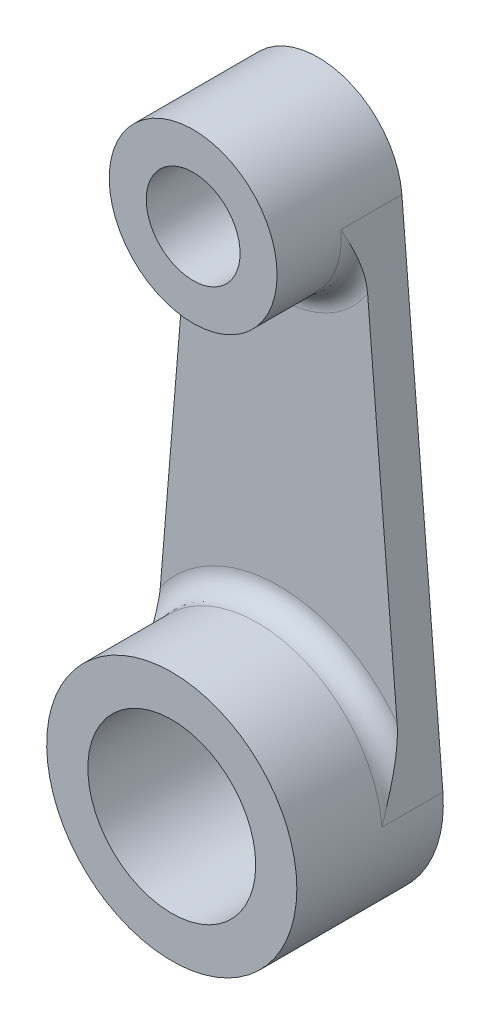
ISO-10303-21;
HEADER;
FILE_DESCRIPTION(('STEP AP214'),'2;1');
FILE_NAME('part.step','',(''),(''),'','','');
FILE_SCHEMA(('AUTOMOTIVE_DESIGN { 1 0 10303 214 1 1 1 1 }'));
ENDSEC;
DATA;
#1=APPLICATION_CONTEXT('core data for automotive mechanical design processes');
#2=APPLICATION_PROTOCOL_DEFINITION('international standard','automotive_design',2000,#1);
#3=PRODUCT_CONTEXT('',#1,'mechanical');
#4=PRODUCT('Part','Part','',(#3));
#5=PRODUCT_RELATED_PRODUCT_CATEGORY('part','',(#4));
#6=PRODUCT_DEFINITION_FORMATION('','',#4);
#7=PRODUCT_DEFINITION_CONTEXT('part definition',#1,'design');
#8=PRODUCT_DEFINITION('design','',#6,#7);
#9=PRODUCT_DEFINITION_SHAPE('','',#8);
#10=(LENGTH_UNIT() NAMED_UNIT(*) SI_UNIT(.MILLI.,.METRE.));
#11=(NAMED_UNIT(*) PLANE_ANGLE_UNIT() SI_UNIT($,.RADIAN.));
#12=(NAMED_UNIT(*) SI_UNIT($,.STERADIAN.) SOLID_ANGLE_UNIT());
#13=UNCERTAINTY_MEASURE_WITH_UNIT(LENGTH_MEASURE(1.E-05),#10,'distance_accuracy_value','');
#14=(GEOMETRIC_REPRESENTATION_CONTEXT(3) GLOBAL_UNCERTAINTY_ASSIGNED_CONTEXT((#13)) GLOBAL_UNIT_ASSIGNED_CONTEXT((#10,
#11,#12)) REPRESENTATION_CONTEXT('',''));
#15=CARTESIAN_POINT('',(0.,0.,0.));
#16=DIRECTION('',(0.,0.,1.));
#17=DIRECTION('',(1.,0.,0.));
#18=AXIS2_PLACEMENT_3D('',#15,#16,#17);
#19=CARTESIAN_POINT('',(0.,0.,44.5));
#20=DIRECTION('',(0.,0.,-1.));
#21=DIRECTION('',(-1.,0.,0.));
#22=AXIS2_PLACEMENT_3D('',#19,#20,#21);
#23=CYLINDRICAL_SURFACE('',#22,38.);
#24=CARTESIAN_POINT('',(0.,0.,18.5));
#25=DIRECTION('',(0.,0.,1.));
#26=DIRECTION('',(1.,0.,0.));
#27=AXIS2_PLACEMENT_3D('',#24,#25,#26);
#28=CIRCLE('',#27,38.);
#29=CARTESIAN_POINT('',(37.8712869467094,3.125,18.5));
#30=VERTEX_POINT('',#29);
#31=CARTESIAN_POINT('',(-37.8712869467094,3.125,18.5));
#32=VERTEX_POINT('',#31);
#33=EDGE_CURVE('E140',#30,#32,#28,.T.);
#34=ORIENTED_EDGE('',*,*,#33,.T.);
#35=DIRECTION('',(0.,0.,-1.));
#36=VECTOR('',#35,1.);
#37=CARTESIAN_POINT('',(-37.8712869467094,3.125,12.));
#38=LINE('',#37,#36);
#39=CARTESIAN_POINT('',(-37.8712869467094,3.125,0.));
#40=VERTEX_POINT('',#39);
#41=EDGE_CURVE('E104',#32,#40,#38,.T.);
#42=ORIENTED_EDGE('',*,*,#41,.T.);
#43=CARTESIAN_POINT('',(0.,0.,0.));
#44=DIRECTION('',(0.,0.,1.));
#45=DIRECTION('',(1.,0.,0.));
#46=AXIS2_PLACEMENT_3D('',#43,#44,#45);
#47=CIRCLE('',#46,38.);
#48=CARTESIAN_POINT('',(37.8712869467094,3.125,0.));
#49=VERTEX_POINT('',#48);
#50=EDGE_CURVE('E103',#40,#49,#47,.T.);
#51=ORIENTED_EDGE('',*,*,#50,.T.);
#52=DIRECTION('',(0.,0.,-1.));
#53=VECTOR('',#52,1.);
#54=CARTESIAN_POINT('',(37.8712869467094,3.125,12.));
#55=LINE('',#54,#53);
#56=EDGE_CURVE('E133',#30,#49,#55,.T.);
#57=ORIENTED_EDGE('',*,*,#56,.F.);
#58=EDGE_LOOP('',(#34,#42,#51,#57));
#59=FACE_BOUND('',#58,.T.);
#60=CARTESIAN_POINT('',(0.,0.,44.5));
#61=DIRECTION('',(0.,0.,1.));
#62=DIRECTION('',(1.,0.,0.));
#63=AXIS2_PLACEMENT_3D('',#60,#61,#62);
#64=CIRCLE('',#63,38.);
#65=CARTESIAN_POINT('',(38.,0.,44.5));
#66=VERTEX_POINT('',#65);
#67=EDGE_CURVE('E137',#66,#66,#64,.T.);
#68=ORIENTED_EDGE('',*,*,#67,.F.);
#69=EDGE_LOOP('',(#68));
#70=FACE_BOUND('',#69,.T.);
#71=ADVANCED_FACE('F39',(#59,#70),#23,.T.);
#72=CARTESIAN_POINT('',(0.,0.,44.5));
#73=DIRECTION('',(0.,0.,1.));
#74=DIRECTION('',(1.,0.,0.));
#75=AXIS2_PLACEMENT_3D('',#72,#73,#74);
#76=PLANE('',#75);
#77=CARTESIAN_POINT('',(0.,0.,44.5));
#78=DIRECTION('',(0.,0.,1.));
#79=DIRECTION('',(1.,0.,0.));
#80=AXIS2_PLACEMENT_3D('',#77,#78,#79);
#81=CIRCLE('',#80,25.5);
#82=CARTESIAN_POINT('',(25.5,0.,44.5));
#83=VERTEX_POINT('',#82);
#84=EDGE_CURVE('E121',#83,#83,#81,.T.);
#85=ORIENTED_EDGE('',*,*,#84,.F.);
#86=EDGE_LOOP('',(#85));
#87=FACE_BOUND('',#86,.T.);
#88=ORIENTED_EDGE('',*,*,#67,.T.);
#89=EDGE_LOOP('',(#88));
#90=FACE_BOUND('',#89,.T.);
#91=ADVANCED_FACE('F175',(#87,#90),#76,.T.);
#92=CARTESIAN_POINT('',(0.,0.,0.));
#93=DIRECTION('',(0.,0.,1.));
#94=DIRECTION('',(1.,0.,0.));
#95=AXIS2_PLACEMENT_3D('',#92,#93,#94);
#96=PLANE('',#95);
#97=CARTESIAN_POINT('',(0.,152.,0.));
#98=DIRECTION('',(0.,0.,1.));
#99=DIRECTION('',(1.,0.,0.));
#100=AXIS2_PLACEMENT_3D('',#97,#98,#99);
#101=CIRCLE('',#100,14.25);
#102=CARTESIAN_POINT('',(14.25,152.,0.));
#103=VERTEX_POINT('',#102);
#104=EDGE_CURVE('E145',#103,#103,#101,.T.);
#105=ORIENTED_EDGE('',*,*,#104,.T.);
#106=EDGE_LOOP('',(#105));
#107=FACE_BOUND('',#106,.T.);
#108=CARTESIAN_POINT('',(0.,0.,0.));
#109=DIRECTION('',(0.,0.,1.));
#110=DIRECTION('',(1.,0.,0.));
#111=AXIS2_PLACEMENT_3D('',#108,#109,#110);
#112=CIRCLE('',#111,25.5);
#113=CARTESIAN_POINT('',(25.5,0.,0.));
#114=VERTEX_POINT('',#113);
#115=EDGE_CURVE('E116',#114,#114,#112,.T.);
#116=ORIENTED_EDGE('',*,*,#115,.T.);
#117=EDGE_LOOP('',(#116));
#118=FACE_BOUND('',#117,.T.);
#119=ORIENTED_EDGE('',*,*,#50,.F.);
#120=DIRECTION('',(-0.0822368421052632,-0.996612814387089,0.));
#121=VECTOR('',#120,1.);
#122=CARTESIAN_POINT('',(-37.8712869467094,3.125,0.));
#123=LINE('',#122,#121);
#124=CARTESIAN_POINT('',(-25.4136267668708,154.097039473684,0.));
#125=VERTEX_POINT('',#124);
#126=EDGE_CURVE('E99',#125,#40,#123,.T.);
#127=ORIENTED_EDGE('',*,*,#126,.F.);
#128=CARTESIAN_POINT('',(0.,152.,0.));
#129=DIRECTION('',(0.,0.,1.));
#130=DIRECTION('',(1.,0.,0.));
#131=AXIS2_PLACEMENT_3D('',#128,#129,#130);
#132=CIRCLE('',#131,25.5);
#133=CARTESIAN_POINT('',(25.4136267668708,154.097039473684,0.));
#134=VERTEX_POINT('',#133);
#135=EDGE_CURVE('E110',#134,#125,#132,.T.);
#136=ORIENTED_EDGE('',*,*,#135,.F.);
#137=DIRECTION('',(0.0822368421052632,-0.996612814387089,0.));
#138=VECTOR('',#137,1.);
#139=CARTESIAN_POINT('',(37.8712869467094,3.125,0.));
#140=LINE('',#139,#138);
#141=EDGE_CURVE('E112',#134,#49,#140,.T.);
#142=ORIENTED_EDGE('',*,*,#141,.T.);
#143=EDGE_LOOP('',(#119,#127,#136,#142));
#144=FACE_BOUND('',#143,.T.);
#145=ADVANCED_FACE('F108',(#107,#118,#144),#96,.F.);
#146=CARTESIAN_POINT('',(-37.8712869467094,3.125,12.));
#147=DIRECTION('',(0.996612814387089,-0.0822368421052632,0.));
#148=DIRECTION('',(0.0822368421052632,0.996612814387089,0.));
#149=AXIS2_PLACEMENT_3D('',#146,#147,#148);
#150=PLANE('',#149);
#151=ORIENTED_EDGE('',*,*,#126,.T.);
#152=ORIENTED_EDGE('',*,*,#41,.F.);
#153=CARTESIAN_POINT('',(-35.9669224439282,26.2036350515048,12.));
#154=CARTESIAN_POINT('',(-35.9853294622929,25.9805638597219,12.0000043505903));
#155=CARTESIAN_POINT('',(-36.0037350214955,25.757510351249,12.0031303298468));
#156=CARTESIAN_POINT('',(-36.0405313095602,25.3115830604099,12.0152626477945));
#157=CARTESIAN_POINT('',(-36.058922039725,25.0887092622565,12.0242683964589));
#158=CARTESIAN_POINT('',(-36.1140366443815,24.4207857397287,12.0595473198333));
#159=CARTESIAN_POINT('',(-36.1507260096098,23.9761542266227,12.0940830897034));
#160=CARTESIAN_POINT('',(-36.2238397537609,23.0901025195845,12.1825233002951));
#161=CARTESIAN_POINT('',(-36.2602645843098,22.6486768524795,12.2363740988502));
#162=CARTESIAN_POINT('',(-36.3329187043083,21.7681952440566,12.3612735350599));
#163=CARTESIAN_POINT('',(-36.3691479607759,21.3291397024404,12.4323249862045));
#164=CARTESIAN_POINT('',(-36.44102151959,20.4581175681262,12.5888989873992));
#165=CARTESIAN_POINT('',(-36.4766680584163,20.0261238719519,12.6742708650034));
#166=CARTESIAN_POINT('',(-36.5477293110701,19.1649459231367,12.8583020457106));
#167=CARTESIAN_POINT('',(-36.5831440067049,18.7357618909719,12.9569623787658));
#168=CARTESIAN_POINT('',(-36.6890829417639,17.4519078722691,13.2707293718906));
#169=CARTESIAN_POINT('',(-36.7592554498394,16.601500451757,13.5035165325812));
#170=CARTESIAN_POINT('',(-36.8732736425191,15.2197354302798,13.91416764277));
#171=CARTESIAN_POINT('',(-36.9173921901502,14.6850710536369,14.0811223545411));
#172=CARTESIAN_POINT('',(-37.0052975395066,13.6197626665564,14.4275558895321));
#173=CARTESIAN_POINT('',(-37.0490843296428,13.0891187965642,14.6070351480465));
#174=CARTESIAN_POINT('',(-37.1800169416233,11.5023711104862,15.1611252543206));
#175=CARTESIAN_POINT('',(-37.2667157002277,10.4516851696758,15.5513168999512));
#176=CARTESIAN_POINT('',(-37.5259131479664,7.31052007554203,16.7630204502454));
#177=CARTESIAN_POINT('',(-37.6971331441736,5.23553716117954,17.6241464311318));
#178=CARTESIAN_POINT('',(-37.8693117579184,3.14893694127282,18.4900664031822));
#179=CARTESIAN_POINT('',(-37.8702993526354,3.13696846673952,18.4950332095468));
#180=CARTESIAN_POINT('',(-37.8712869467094,3.125,18.5));
#181=B_SPLINE_CURVE_WITH_KNOTS('',3,(#153,#154,#155,#156,#157,#158,#159,#160,#161,#162,#163,
#164,#165,#166,#167,#168,#169,#170,#171,#172,#173,#174,#175,#176,#177,#178,#179,#180),
.UNSPECIFIED.,.F.,.F.,(4,2,2,2,2,2,2,2,2,2,2,2,2,4),(0.,0.67143658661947,1.34280580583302,
2.68470339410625,4.02290272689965,5.36132109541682,6.68645163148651,8.0116849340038,
10.6638774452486,12.3493322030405,14.0348455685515,17.4066079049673,24.1646919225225,
24.203679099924),.UNSPECIFIED.);
#182=CARTESIAN_POINT('',(-35.9669224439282,26.2036350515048,12.));
#183=VERTEX_POINT('',#182);
#184=EDGE_CURVE('E154',#32,#183,#181,.F.);
#185=ORIENTED_EDGE('',*,*,#184,.T.);
#186=DIRECTION('',(-0.0822368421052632,-0.996612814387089,0.));
#187=VECTOR('',#186,1.);
#188=CARTESIAN_POINT('',(-37.8712869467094,3.125,12.));
#189=LINE('',#188,#187);
#190=CARTESIAN_POINT('',(-27.0034799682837,134.829907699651,12.));
#191=VERTEX_POINT('',#190);
#192=EDGE_CURVE('E125',#191,#183,#189,.T.);
#193=ORIENTED_EDGE('',*,*,#192,.F.);
#194=CARTESIAN_POINT('',(-27.0034799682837,134.829907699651,12.));
#195=CARTESIAN_POINT('',(-26.9754955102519,135.169046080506,12.000030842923));
#196=CARTESIAN_POINT('',(-26.947519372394,135.508083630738,12.0097513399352));
#197=CARTESIAN_POINT('',(-26.891660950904,136.185021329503,12.0468251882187));
#198=CARTESIAN_POINT('',(-26.8637786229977,136.522922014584,12.0741685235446));
#199=CARTESIAN_POINT('',(-26.8082350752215,137.196043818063,12.1446415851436));
#200=CARTESIAN_POINT('',(-26.7805734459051,137.531269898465,12.1877245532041));
#201=CARTESIAN_POINT('',(-26.7254240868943,138.199614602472,12.2881780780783));
#202=CARTESIAN_POINT('',(-26.6979363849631,138.532732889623,12.3455508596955));
#203=CARTESIAN_POINT('',(-26.6165099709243,139.519524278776,12.5352853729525));
#204=CARTESIAN_POINT('',(-26.5628619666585,140.16967434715,12.6862892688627));
#205=CARTESIAN_POINT('',(-26.4564288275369,141.45951753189,13.0291653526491));
#206=CARTESIAN_POINT('',(-26.4036444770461,142.099201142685,13.2210726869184));
#207=CARTESIAN_POINT('',(-26.310818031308,143.224147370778,13.5906318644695));
#208=CARTESIAN_POINT('',(-26.2705958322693,143.711592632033,13.76167991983));
#209=CARTESIAN_POINT('',(-26.1906516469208,144.68042117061,14.1203147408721));
#210=CARTESIAN_POINT('',(-26.150929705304,145.161803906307,14.3079029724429));
#211=CARTESIAN_POINT('',(-26.0324482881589,146.597657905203,14.8910785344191));
#212=CARTESIAN_POINT('',(-25.9543705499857,147.543867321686,15.3070877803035));
#213=CARTESIAN_POINT('',(-25.7992276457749,149.424014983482,16.1749934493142));
#214=CARTESIAN_POINT('',(-25.7221677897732,150.35788887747,16.6270269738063));
#215=CARTESIAN_POINT('',(-25.5687275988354,152.217401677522,17.5478846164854));
#216=CARTESIAN_POINT('',(-25.4923473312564,153.143039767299,18.0167103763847));
#217=CARTESIAN_POINT('',(-25.4151898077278,154.078097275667,18.4904039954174));
#218=CARTESIAN_POINT('',(-25.4144082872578,154.087568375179,18.4952019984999));
#219=CARTESIAN_POINT('',(-25.4136267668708,154.097039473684,18.5));
#220=B_SPLINE_CURVE_WITH_KNOTS('',3,(#194,#195,#196,#197,#198,#199,#200,#201,#202,#203,#204,
#205,#206,#207,#208,#209,#210,#211,#212,#213,#214,#215,#216,#217,#218,#219),.UNSPECIFIED.,.F.,
.F.,(4,2,2,2,2,2,2,2,2,2,2,2,4),(0.,1.02058876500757,2.04059798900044,3.05760135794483,
4.07476316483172,6.08177897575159,8.09052632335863,9.64464139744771,11.1988943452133,
14.3072975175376,17.4281542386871,20.549316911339,20.5812543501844),.UNSPECIFIED.);
#221=CARTESIAN_POINT('',(-25.4136267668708,154.097039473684,18.5));
#222=VERTEX_POINT('',#221);
#223=EDGE_CURVE('E11',#191,#222,#220,.T.);
#224=ORIENTED_EDGE('',*,*,#223,.T.);
#225=DIRECTION('',(0.,0.,-1.));
#226=VECTOR('',#225,1.);
#227=CARTESIAN_POINT('',(-25.4136267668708,154.097039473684,12.));
#228=LINE('',#227,#226);
#229=EDGE_CURVE('E68',#222,#125,#228,.T.);
#230=ORIENTED_EDGE('',*,*,#229,.T.);
#231=EDGE_LOOP('',(#151,#152,#185,#193,#224,#230));
#232=FACE_BOUND('',#231,.T.);
#233=ADVANCED_FACE('F98',(#232),#150,.F.);
#234=CARTESIAN_POINT('',(37.8712869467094,3.125,12.));
#235=DIRECTION('',(0.996612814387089,0.0822368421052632,0.));
#236=DIRECTION('',(-0.0822368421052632,0.996612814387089,0.));
#237=AXIS2_PLACEMENT_3D('',#234,#235,#236);
#238=PLANE('',#237);
#239=ORIENTED_EDGE('',*,*,#141,.F.);
#240=DIRECTION('',(0.,0.,-1.));
#241=VECTOR('',#240,1.);
#242=CARTESIAN_POINT('',(25.4136267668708,154.097039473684,12.));
#243=LINE('',#242,#241);
#244=CARTESIAN_POINT('',(25.4136267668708,154.097039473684,18.5));
#245=VERTEX_POINT('',#244);
#246=EDGE_CURVE('E60',#245,#134,#243,.T.);
#247=ORIENTED_EDGE('',*,*,#246,.F.);
#248=CARTESIAN_POINT('',(27.0034799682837,134.829907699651,12.));
#249=CARTESIAN_POINT('',(26.975495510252,135.169046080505,12.000030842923));
#250=CARTESIAN_POINT('',(26.9475193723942,135.508083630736,12.0097513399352));
#251=CARTESIAN_POINT('',(26.8916609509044,136.185021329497,12.0468251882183));
#252=CARTESIAN_POINT('',(26.8637786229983,136.522922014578,12.074168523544));
#253=CARTESIAN_POINT('',(26.8082350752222,137.196043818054,12.1446415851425));
#254=CARTESIAN_POINT('',(26.7805734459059,137.531269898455,12.1877245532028));
#255=CARTESIAN_POINT('',(26.7254240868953,138.19961460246,12.2881780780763));
#256=CARTESIAN_POINT('',(26.6979363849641,138.53273288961,12.3455508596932));
#257=CARTESIAN_POINT('',(26.6165099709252,139.519524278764,12.53528537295));
#258=CARTESIAN_POINT('',(26.5628619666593,140.169674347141,12.6862892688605));
#259=CARTESIAN_POINT('',(26.4564288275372,141.459517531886,13.0291653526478));
#260=CARTESIAN_POINT('',(26.4036444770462,142.099201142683,13.2210726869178));
#261=CARTESIAN_POINT('',(26.3108180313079,143.224147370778,13.5906318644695));
#262=CARTESIAN_POINT('',(26.2705958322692,143.711592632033,13.7616799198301));
#263=CARTESIAN_POINT('',(26.1906516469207,144.680421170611,14.1203147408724));
#264=CARTESIAN_POINT('',(26.1509297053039,145.161803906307,14.3079029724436));
#265=CARTESIAN_POINT('',(26.0324482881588,146.597657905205,14.8910785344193));
#266=CARTESIAN_POINT('',(25.9543705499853,147.54386732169,15.3070877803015));
#267=CARTESIAN_POINT('',(25.7992276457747,149.424014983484,16.174993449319));
#268=CARTESIAN_POINT('',(25.7221677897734,150.357888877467,16.6270269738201));
#269=CARTESIAN_POINT('',(25.5687275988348,152.21740167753,17.5478846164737));
#270=CARTESIAN_POINT('',(25.4923473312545,153.143039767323,18.0167103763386));
#271=CARTESIAN_POINT('',(25.4151898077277,154.078097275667,18.4904039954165));
#272=CARTESIAN_POINT('',(25.4144082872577,154.087568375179,18.4952019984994));
#273=CARTESIAN_POINT('',(25.4136267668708,154.097039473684,18.5));
#274=B_SPLINE_CURVE_WITH_KNOTS('',3,(#248,#249,#250,#251,#252,#253,#254,#255,#256,#257,#258,
#259,#260,#261,#262,#263,#264,#265,#266,#267,#268,#269,#270,#271,#272,#273),.UNSPECIFIED.,.F.,
.F.,(4,2,2,2,2,2,2,2,2,2,2,2,4),(0.,1.02058876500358,2.04059798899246,3.05760135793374,
4.07476316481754,6.08177897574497,8.09052632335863,9.64464139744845,11.1988943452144,
14.3072975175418,17.4281542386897,20.549316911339,20.5812543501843),.UNSPECIFIED.);
#275=CARTESIAN_POINT('',(27.0034799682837,134.829907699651,12.));
#276=VERTEX_POINT('',#275);
#277=EDGE_CURVE('E53',#245,#276,#274,.F.);
#278=ORIENTED_EDGE('',*,*,#277,.T.);
#279=DIRECTION('',(0.0822368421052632,-0.996612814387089,0.));
#280=VECTOR('',#279,1.);
#281=CARTESIAN_POINT('',(37.8712869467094,3.125,12.));
#282=LINE('',#281,#280);
#283=CARTESIAN_POINT('',(35.9669224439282,26.2036350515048,12.));
#284=VERTEX_POINT('',#283);
#285=EDGE_CURVE('E128',#276,#284,#282,.T.);
#286=ORIENTED_EDGE('',*,*,#285,.T.);
#287=CARTESIAN_POINT('',(35.9669224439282,26.2036350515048,12.));
#288=CARTESIAN_POINT('',(35.9853294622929,25.9805638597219,12.0000043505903));
#289=CARTESIAN_POINT('',(36.0037350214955,25.757510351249,12.0031303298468));
#290=CARTESIAN_POINT('',(36.0405313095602,25.3115830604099,12.0152626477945));
#291=CARTESIAN_POINT('',(36.058922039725,25.0887092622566,12.0242683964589));
#292=CARTESIAN_POINT('',(36.1140366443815,24.4207857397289,12.0595473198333));
#293=CARTESIAN_POINT('',(36.1507260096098,23.9761542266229,12.0940830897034));
#294=CARTESIAN_POINT('',(36.2238397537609,23.0901025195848,12.1825233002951));
#295=CARTESIAN_POINT('',(36.2602645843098,22.6486768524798,12.2363740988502));
#296=CARTESIAN_POINT('',(36.3329187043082,21.768195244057,12.3612735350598));
#297=CARTESIAN_POINT('',(36.3691479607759,21.3291397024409,12.4323249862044));
#298=CARTESIAN_POINT('',(36.44102151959,20.4581175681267,12.5888989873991));
#299=CARTESIAN_POINT('',(36.4766680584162,20.0261238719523,12.6742708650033));
#300=CARTESIAN_POINT('',(36.5477293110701,19.164945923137,12.8583020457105));
#301=CARTESIAN_POINT('',(36.5831440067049,18.7357618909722,12.9569623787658));
#302=CARTESIAN_POINT('',(36.6890829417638,17.4519078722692,13.2707293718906));
#303=CARTESIAN_POINT('',(36.7592554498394,16.6015004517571,13.5035165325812));
#304=CARTESIAN_POINT('',(36.8732736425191,15.2197354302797,13.91416764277));
#305=CARTESIAN_POINT('',(36.9173921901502,14.6850710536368,14.0811223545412));
#306=CARTESIAN_POINT('',(37.0052975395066,13.6197626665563,14.4275558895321));
#307=CARTESIAN_POINT('',(37.0490843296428,13.0891187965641,14.6070351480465));
#308=CARTESIAN_POINT('',(37.1800169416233,11.502371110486,15.1611252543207));
#309=CARTESIAN_POINT('',(37.2667157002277,10.4516851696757,15.5513168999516));
#310=CARTESIAN_POINT('',(37.5259131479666,7.31052007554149,16.7630204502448));
#311=CARTESIAN_POINT('',(37.6971331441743,5.23553716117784,17.6241464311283));
#312=CARTESIAN_POINT('',(37.8693117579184,3.14893694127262,18.4900664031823));
#313=CARTESIAN_POINT('',(37.8702993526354,3.13696846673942,18.4950332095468));
#314=CARTESIAN_POINT('',(37.8712869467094,3.125,18.5));
#315=B_SPLINE_CURVE_WITH_KNOTS('',3,(#287,#288,#289,#290,#291,#292,#293,#294,#295,#296,#297,
#298,#299,#300,#301,#302,#303,#304,#305,#306,#307,#308,#309,#310,#311,#312,#313,#314),
.UNSPECIFIED.,.F.,.F.,(4,2,2,2,2,2,2,2,2,2,2,2,2,4),(0.,0.671436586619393,1.34280580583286,
2.68470339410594,4.02290272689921,5.36132109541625,6.6864516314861,8.01168493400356,
10.6638774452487,12.3493322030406,14.0348455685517,17.4066079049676,24.1646919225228,
24.203679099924),.UNSPECIFIED.);
#316=EDGE_CURVE('E160',#284,#30,#315,.T.);
#317=ORIENTED_EDGE('',*,*,#316,.T.);
#318=ORIENTED_EDGE('',*,*,#56,.T.);
#319=EDGE_LOOP('',(#239,#247,#278,#286,#317,#318));
#320=FACE_BOUND('',#319,.T.);
#321=ADVANCED_FACE('F172',(#320),#238,.T.);
#322=CARTESIAN_POINT('',(0.,0.,12.));
#323=DIRECTION('',(0.,0.,1.));
#324=DIRECTION('',(1.,0.,0.));
#325=AXIS2_PLACEMENT_3D('',#322,#323,#324);
#326=PLANE('',#325);
#327=ORIENTED_EDGE('',*,*,#192,.T.);
#328=CARTESIAN_POINT('',(0.,0.,12.));
#329=DIRECTION('',(0.,0.,1.));
#330=DIRECTION('',(1.,0.,0.));
#331=AXIS2_PLACEMENT_3D('',#328,#329,#330);
#332=CIRCLE('',#331,44.5);
#333=EDGE_CURVE('E150',#183,#284,#332,.F.);
#334=ORIENTED_EDGE('',*,*,#333,.T.);
#335=ORIENTED_EDGE('',*,*,#285,.F.);
#336=CARTESIAN_POINT('',(0.,152.,12.));
#337=DIRECTION('',(0.,0.,1.));
#338=DIRECTION('',(1.,0.,0.));
#339=AXIS2_PLACEMENT_3D('',#336,#337,#338);
#340=CIRCLE('',#339,32.);
#341=EDGE_CURVE('E148',#276,#191,#340,.F.);
#342=ORIENTED_EDGE('',*,*,#341,.T.);
#343=EDGE_LOOP('',(#327,#334,#335,#342));
#344=FACE_BOUND('',#343,.T.);
#345=ADVANCED_FACE('F197',(#344),#326,.T.);
#346=CARTESIAN_POINT('',(0.,152.,38.));
#347=DIRECTION('',(0.,0.,-1.));
#348=DIRECTION('',(-1.,0.,0.));
#349=AXIS2_PLACEMENT_3D('',#346,#347,#348);
#350=CYLINDRICAL_SURFACE('',#349,25.5);
#351=CARTESIAN_POINT('',(0.,152.,38.));
#352=DIRECTION('',(0.,0.,1.));
#353=DIRECTION('',(1.,0.,0.));
#354=AXIS2_PLACEMENT_3D('',#351,#352,#353);
#355=CIRCLE('',#354,25.5);
#356=CARTESIAN_POINT('',(25.5,152.,38.));
#357=VERTEX_POINT('',#356);
#358=EDGE_CURVE('E113',#357,#357,#355,.T.);
#359=ORIENTED_EDGE('',*,*,#358,.F.);
#360=EDGE_LOOP('',(#359));
#361=FACE_BOUND('',#360,.T.);
#362=CARTESIAN_POINT('',(0.,152.,18.5));
#363=DIRECTION('',(0.,0.,1.));
#364=DIRECTION('',(1.,0.,0.));
#365=AXIS2_PLACEMENT_3D('',#362,#363,#364);
#366=CIRCLE('',#365,25.5);
#367=EDGE_CURVE('E152',#222,#245,#366,.T.);
#368=ORIENTED_EDGE('',*,*,#367,.T.);
#369=ORIENTED_EDGE('',*,*,#246,.T.);
#370=ORIENTED_EDGE('',*,*,#135,.T.);
#371=ORIENTED_EDGE('',*,*,#229,.F.);
#372=EDGE_LOOP('',(#368,#369,#370,#371));
#373=FACE_BOUND('',#372,.T.);
#374=ADVANCED_FACE('F115',(#361,#373),#350,.T.);
#375=CARTESIAN_POINT('',(0.,0.,38.));
#376=DIRECTION('',(0.,0.,1.));
#377=DIRECTION('',(1.,0.,0.));
#378=AXIS2_PLACEMENT_3D('',#375,#376,#377);
#379=PLANE('',#378);
#380=CARTESIAN_POINT('',(0.,152.,38.));
#381=DIRECTION('',(0.,0.,1.));
#382=DIRECTION('',(1.,0.,0.));
#383=AXIS2_PLACEMENT_3D('',#380,#381,#382);
#384=CIRCLE('',#383,14.25);
#385=CARTESIAN_POINT('',(14.25,152.,38.));
#386=VERTEX_POINT('',#385);
#387=EDGE_CURVE('E142',#386,#386,#384,.T.);
#388=ORIENTED_EDGE('',*,*,#387,.F.);
#389=EDGE_LOOP('',(#388));
#390=FACE_BOUND('',#389,.T.);
#391=ORIENTED_EDGE('',*,*,#358,.T.);
#392=EDGE_LOOP('',(#391));
#393=FACE_BOUND('',#392,.T.);
#394=ADVANCED_FACE('F212',(#390,#393),#379,.T.);
#395=CARTESIAN_POINT('',(0.,0.,0.));
#396=DIRECTION('',(0.,0.,1.));
#397=DIRECTION('',(1.,0.,0.));
#398=AXIS2_PLACEMENT_3D('',#395,#396,#397);
#399=CYLINDRICAL_SURFACE('',#398,25.5);
#400=ORIENTED_EDGE('',*,*,#115,.F.);
#401=EDGE_LOOP('',(#400));
#402=FACE_BOUND('',#401,.T.);
#403=ORIENTED_EDGE('',*,*,#84,.T.);
#404=EDGE_LOOP('',(#403));
#405=FACE_BOUND('',#404,.T.);
#406=ADVANCED_FACE('F218',(#402,#405),#399,.F.);
#407=CARTESIAN_POINT('',(0.,152.,0.));
#408=DIRECTION('',(0.,0.,1.));
#409=DIRECTION('',(1.,0.,0.));
#410=AXIS2_PLACEMENT_3D('',#407,#408,#409);
#411=CYLINDRICAL_SURFACE('',#410,14.25);
#412=ORIENTED_EDGE('',*,*,#387,.T.);
#413=EDGE_LOOP('',(#412));
#414=FACE_BOUND('',#413,.T.);
#415=ORIENTED_EDGE('',*,*,#104,.F.);
#416=EDGE_LOOP('',(#415));
#417=FACE_BOUND('',#416,.T.);
#418=ADVANCED_FACE('F222',(#414,#417),#411,.F.);
#419=CARTESIAN_POINT('',(0.,0.,18.5));
#420=DIRECTION('',(0.,0.,1.));
#421=DIRECTION('',(1.,0.,0.));
#422=AXIS2_PLACEMENT_3D('',#419,#420,#421);
#423=TOROIDAL_SURFACE('',#422,44.5,6.5);
#424=ORIENTED_EDGE('',*,*,#316,.F.);
#425=ORIENTED_EDGE('',*,*,#333,.F.);
#426=ORIENTED_EDGE('',*,*,#184,.F.);
#427=ORIENTED_EDGE('',*,*,#33,.F.);
#428=EDGE_LOOP('',(#424,#425,#426,#427));
#429=FACE_BOUND('',#428,.T.);
#430=ADVANCED_FACE('F166',(#429),#423,.F.);
#431=CARTESIAN_POINT('',(0.,152.,18.5));
#432=DIRECTION('',(0.,0.,1.));
#433=DIRECTION('',(1.,0.,0.));
#434=AXIS2_PLACEMENT_3D('',#431,#432,#433);
#435=TOROIDAL_SURFACE('',#434,32.,6.5);
#436=ORIENTED_EDGE('',*,*,#223,.F.);
#437=ORIENTED_EDGE('',*,*,#341,.F.);
#438=ORIENTED_EDGE('',*,*,#277,.F.);
#439=ORIENTED_EDGE('',*,*,#367,.F.);
#440=EDGE_LOOP('',(#436,#437,#438,#439));
#441=FACE_BOUND('',#440,.T.);
#442=ADVANCED_FACE('F41',(#441),#435,.F.);
#443=CLOSED_SHELL('',(#71,#91,#145,#233,#321,#345,#374,#394,#406,#418,#430,#442));
#444=MANIFOLD_SOLID_BREP('B2',#443);
#445=ADVANCED_BREP_SHAPE_REPRESENTATION('',(#18,#444),#14);
#446=SHAPE_DEFINITION_REPRESENTATION(#9,#445);
ENDSEC;
END-ISO-10303-21;
